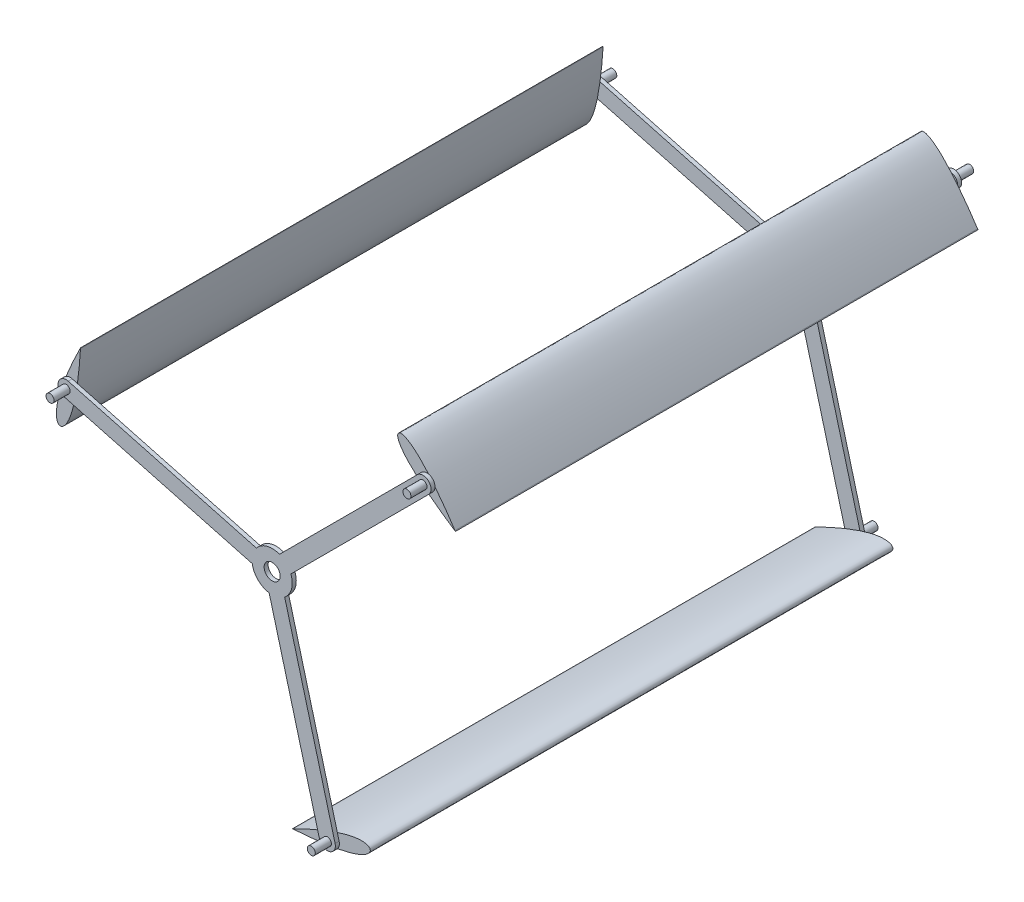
from build123d import *

# Parameters (mm, degrees)
BOSS_EXTRUDE1_DEPTH   = 650
BOSS_EXTRUDE1_2_DEPTH = 650
BOSS_EXTRUDE1_3_DEPTH = 650
SKETCH5_R             = 5
BOSS_EXTRUDE3_DEPTH   = 350
SKETCH3_R             = 10
BOSS_EXTRUDE2_DEPTH   = 5


with BuildPart() as part:
    # Sketch2 → Boss-Extrude1 (new body)
    with BuildSketch(Plane.XY):
        with BuildLine():
            Line((222.463797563, 153.034328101), (222.971969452, 152.261291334))
            Line((222.971969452, 152.261291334), (222.198932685, 152.769463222))
            add(Edge.make_bspline(
                [(222.463797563, 153.034328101), (221.537840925, 154.442903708), (219.688009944, 157.256887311), (215.9143261, 162.819399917), (211.107514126, 169.683248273), (205.194442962, 177.786001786), (199.137847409, 185.743065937), (192.908088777, 193.527158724), (186.450288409, 201.086583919), (180.798559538, 207.12961694), (176.045354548, 211.726648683), (172.328379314, 215.028028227), (168.411412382, 218.142610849), (164.924624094, 220.508144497), (161.923966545, 222.175241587), (159.468039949, 223.28387091), (157.163981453, 223.965510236), (154.668778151, 224.216709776), (151.88191282, 223.351347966), (151.01655101, 220.564482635), (151.26775055, 218.069279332), (151.949389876, 215.765220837), (153.058019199, 213.309294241), (154.725116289, 210.308636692), (157.090649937, 206.821848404), (160.205232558, 202.904881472), (163.506612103, 199.187906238), (168.103643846, 194.434701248), (174.146676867, 188.782972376), (181.706102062, 182.325172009), (189.490194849, 176.095413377), (197.447259, 170.038817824), (205.550012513, 164.12574666), (212.413860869, 159.318934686), (217.976373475, 155.545250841), (220.790357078, 153.69541986), (222.198932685, 152.769463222)],
                knots=[0, 0, 0, 0, 0.024603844, 0.049152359, 0.098108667, 0.146905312, 0.195554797, 0.244056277, 0.292409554, 0.340643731, 0.364754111, 0.3889056, 0.413178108, 0.437756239, 0.450304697, 0.463229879, 0.477067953, 0.485035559, 0.5, 0.514964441, 0.522932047, 0.536770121, 0.549695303, 0.562243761, 0.586821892, 0.6110944, 0.635245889, 0.659356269, 0.707590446, 0.755943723, 0.804445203, 0.853094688, 0.901891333, 0.950847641, 0.975396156, 1, 1, 1, 1], degree=3))
        make_face()
    extrude(amount=BOSS_EXTRUDE1_DEPTH)



with BuildPart() as body_2:
    # Sketch2 → Boss-Extrude1 2 (new body)
    with BuildSketch(Plane.XY):
        with BuildLine():
            Line((21.202769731, -268.81465201), (20.376161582, -269.230035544))
            Line((20.376161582, -269.230035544), (21.299717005, -269.176464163))
            add(Edge.make_bspline(
                [(21.299717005, -269.176464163), (22.982557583, -269.078849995), (26.344454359, -268.883841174), (33.048573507, -268.396991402), (41.396246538, -267.666094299), (51.369972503, -266.596601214), (61.289289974, -265.32996768), (71.145391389, -263.826884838), (80.920945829, -262.013978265), (88.980230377, -260.140953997), (95.337979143, -258.323073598), (100.055545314, -256.754768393), (104.711336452, -254.919866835), (108.503342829, -253.082986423), (111.447420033, -251.317889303), (113.635484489, -249.745309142), (115.377830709, -248.090755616), (116.842977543, -246.055445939), (117.486984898, -243.20926886), (115.506169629, -241.066410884), (113.219660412, -240.036354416), (110.88346756, -239.474642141), (108.202258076, -239.20678), (104.770063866, -239.150199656), (100.567649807, -239.455417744), (95.618165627, -240.194241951), (90.748480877, -241.194832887), (84.333568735, -242.799376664), (76.417511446, -245.20693234), (67.045179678, -248.524686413), (57.75800405, -252.151029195), (48.534306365, -256.013751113), (39.362059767, -260.074405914), (31.767314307, -263.615266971), (25.717951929, -266.545702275), (22.708959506, -268.05776807), (21.202769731, -268.81465201)],
                knots=[0, 0, 0, 0, 0.024603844, 0.049152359, 0.098108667, 0.146905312, 0.195554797, 0.244056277, 0.292409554, 0.340643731, 0.364754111, 0.3889056, 0.413178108, 0.437756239, 0.450304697, 0.463229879, 0.477067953, 0.485035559, 0.5, 0.514964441, 0.522932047, 0.536770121, 0.549695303, 0.562243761, 0.586821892, 0.6110944, 0.635245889, 0.659356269, 0.707590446, 0.755943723, 0.804445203, 0.853094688, 0.901891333, 0.950847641, 0.975396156, 1, 1, 1, 1], degree=3))
        make_face()
    extrude(amount=BOSS_EXTRUDE1_2_DEPTH)


with BuildPart() as body_3:
    # Sketch2 → Boss-Extrude1 3 (new body)
    with BuildSketch(Plane.XY):
        with BuildLine():
            Line((-243.401702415, 116.045188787), (-243.348131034, 116.968744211))
            Line((-243.348131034, 116.968744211), (-243.763514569, 116.142136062))
            add(Edge.make_bspline(
                [(-243.763514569, 116.142136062), (-244.520398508, 114.635946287), (-246.032464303, 111.626953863), (-248.962899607, 105.577591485), (-252.503760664, 97.982846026), (-256.564415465, 88.810599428), (-260.427137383, 79.586901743), (-264.053480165, 70.299726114), (-267.371234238, 60.927394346), (-269.778789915, 53.011337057), (-271.383333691, 46.596424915), (-272.383924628, 41.726740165), (-273.122748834, 36.777255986), (-273.427966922, 32.574841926), (-273.371386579, 29.142647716), (-273.103524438, 26.461438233), (-272.541812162, 24.125245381), (-271.511755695, 21.838736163), (-269.368897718, 19.857920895), (-266.522720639, 20.501928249), (-264.487410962, 21.967075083), (-262.832857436, 23.709421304), (-261.260277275, 25.897485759), (-259.495180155, 28.841562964), (-257.658299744, 32.633569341), (-255.823398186, 37.289360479), (-254.255092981, 42.006926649), (-252.437212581, 48.364675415), (-250.564188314, 56.423959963), (-248.75128174, 66.199514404), (-247.248198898, 76.055615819), (-245.981565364, 85.974933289), (-244.912072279, 95.948659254), (-244.181175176, 104.296332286), (-243.694325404, 111.000451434), (-243.499316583, 114.36234821), (-243.401702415, 116.045188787)],
                knots=[0, 0, 0, 0, 0.024603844, 0.049152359, 0.098108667, 0.146905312, 0.195554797, 0.244056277, 0.292409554, 0.340643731, 0.364754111, 0.3889056, 0.413178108, 0.437756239, 0.450304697, 0.463229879, 0.477067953, 0.485035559, 0.5, 0.514964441, 0.522932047, 0.536770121, 0.549695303, 0.562243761, 0.586821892, 0.6110944, 0.635245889, 0.659356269, 0.707590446, 0.755943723, 0.804445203, 0.853094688, 0.901891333, 0.950847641, 0.975396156, 1, 1, 1, 1], degree=3))
        make_face()
    extrude(amount=BOSS_EXTRUDE1_3_DEPTH)


with BuildPart() as part_1:
    add(part.part)

    add(body_2.part)  # Boss-Extrude3 merges body 2

    add(body_3.part)  # Boss-Extrude3 merges body 3
    # Sketch5 → Boss-Extrude3 (add, symmetric)
    with BuildSketch(Plane(origin=(0, 0, 325), x_dir=(-1, 0, 0), z_dir=(0, 0, -1))):
        with Locations((-187.616630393, 187.616630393)):
            Circle(SKETCH5_R)
        with Locations((256.289083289, 68.672452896)):
            Circle(SKETCH5_R)
        with Locations((-68.672452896, -256.289083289)):
            Circle(SKETCH5_R)
    extrude(amount=BOSS_EXTRUDE3_DEPTH, both=True)

    # Sketch3 → Boss-Extrude2 (add)
    with BuildSketch(Plane(origin=(0, 0, 0), x_dir=(-1, 0, 0), z_dir=(0, 0, -1))):
        with BuildLine():
            Line((24.720331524, -3.728968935), (258.87727374, 59.013194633))
            ThreePointArc((258.87727374, 59.013194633), (265.948341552, 71.260643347), (253.700892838, 78.331711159))
            Line((253.700892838, 78.331711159), (19.543950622, 15.58954759))
            ThreePointArc((19.543950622, 15.58954759), (6.470476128, 24.148145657), (-9.130783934, 23.272919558))
            Line((-9.130783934, 23.272919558), (-180.545562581, 194.687698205))
            ThreePointArc((-180.545562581, 194.687698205), (-194.687698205, 194.687698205), (-194.687698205, 180.545562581))
            Line((-194.687698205, 180.545562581), (-23.272919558, 9.130783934))
            ThreePointArc((-23.272919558, 9.130783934), (-24.148145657, -6.470476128), (-15.58954759, -19.543950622))
            Line((-15.58954759, -19.543950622), (-78.331711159, -253.700892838))
            ThreePointArc((-78.331711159, -253.700892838), (-71.260643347, -265.948341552), (-59.013194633, -258.87727374))
            Line((-59.013194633, -258.87727374), (3.728968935, -24.720331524))
            ThreePointArc((3.728968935, -24.720331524), (17.67766953, -17.67766953), (24.720331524, -3.728968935))
        make_face()
        Circle(SKETCH3_R, mode=Mode.SUBTRACT)
    boss_extrude2 = extrude(amount=BOSS_EXTRUDE2_DEPTH)

    # Mirror1: Boss-Extrude2 across plane
    add(boss_extrude2.mirror(Plane(origin=(0, 0, 325), x_dir=(1, 0, 0), z_dir=(0, 0, -1))))


solid = part_1.part
